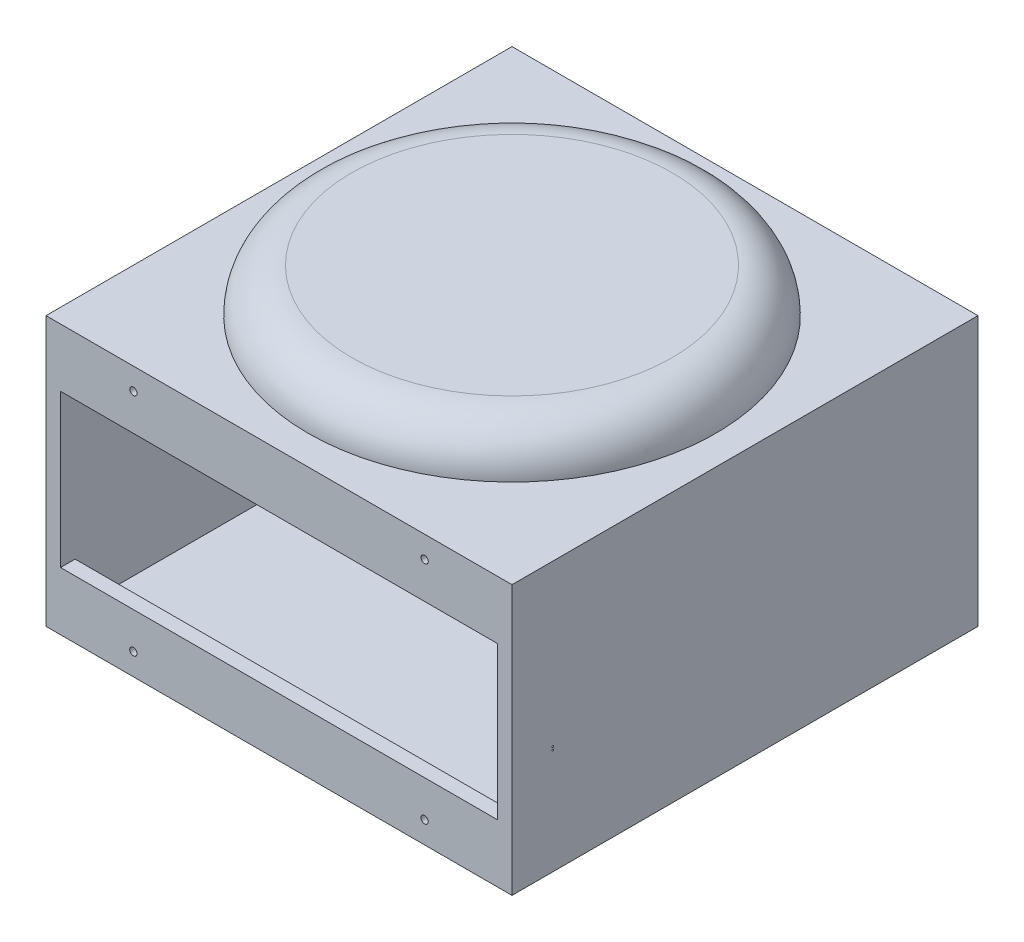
ISO-10303-21;
HEADER;
FILE_DESCRIPTION(('STEP AP214'),'2;1');
FILE_NAME('part.step','',(''),(''),'','','');
FILE_SCHEMA(('AUTOMOTIVE_DESIGN { 1 0 10303 214 1 1 1 1 }'));
ENDSEC;
DATA;
#1=APPLICATION_CONTEXT('core data for automotive mechanical design processes');
#2=APPLICATION_PROTOCOL_DEFINITION('international standard','automotive_design',2000,#1);
#3=PRODUCT_CONTEXT('',#1,'mechanical');
#4=PRODUCT('Part','Part','',(#3));
#5=PRODUCT_RELATED_PRODUCT_CATEGORY('part','',(#4));
#6=PRODUCT_DEFINITION_FORMATION('','',#4);
#7=PRODUCT_DEFINITION_CONTEXT('part definition',#1,'design');
#8=PRODUCT_DEFINITION('design','',#6,#7);
#9=PRODUCT_DEFINITION_SHAPE('','',#8);
#10=(LENGTH_UNIT() NAMED_UNIT(*) SI_UNIT(.MILLI.,.METRE.));
#11=(NAMED_UNIT(*) PLANE_ANGLE_UNIT() SI_UNIT($,.RADIAN.));
#12=(NAMED_UNIT(*) SI_UNIT($,.STERADIAN.) SOLID_ANGLE_UNIT());
#13=UNCERTAINTY_MEASURE_WITH_UNIT(LENGTH_MEASURE(1.E-05),#10,'distance_accuracy_value','');
#14=(GEOMETRIC_REPRESENTATION_CONTEXT(3) GLOBAL_UNCERTAINTY_ASSIGNED_CONTEXT((#13)) GLOBAL_UNIT_ASSIGNED_CONTEXT((#10,
#11,#12)) REPRESENTATION_CONTEXT('',''));
#15=CARTESIAN_POINT('',(0.,0.,0.));
#16=DIRECTION('',(0.,0.,1.));
#17=DIRECTION('',(1.,0.,0.));
#18=AXIS2_PLACEMENT_3D('',#15,#16,#17);
#19=CARTESIAN_POINT('',(6.34999999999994,6.35,6.34999999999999));
#20=DIRECTION('',(-1.,0.,0.));
#21=DIRECTION('',(0.,0.,1.));
#22=AXIS2_PLACEMENT_3D('',#19,#20,#21);
#23=PLANE('',#22);
#24=DIRECTION('',(0.,-1.,0.));
#25=VECTOR('',#24,1.);
#26=CARTESIAN_POINT('',(6.34999999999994,25.4000000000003,196.85));
#27=LINE('',#26,#25);
#28=CARTESIAN_POINT('',(6.34999999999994,25.4000000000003,196.85));
#29=VERTEX_POINT('',#28);
#30=CARTESIAN_POINT('',(6.34999999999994,6.35,196.85));
#31=VERTEX_POINT('',#30);
#32=EDGE_CURVE('E150',#29,#31,#27,.T.);
#33=ORIENTED_EDGE('',*,*,#32,.T.);
#34=DIRECTION('',(0.,0.,1.));
#35=VECTOR('',#34,1.);
#36=CARTESIAN_POINT('',(6.34999999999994,6.35,6.34999999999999));
#37=LINE('',#36,#35);
#38=CARTESIAN_POINT('',(6.34999999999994,6.35,6.34999999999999));
#39=VERTEX_POINT('',#38);
#40=EDGE_CURVE('E137',#39,#31,#37,.T.);
#41=ORIENTED_EDGE('',*,*,#40,.F.);
#42=DIRECTION('',(0.,-1.,0.));
#43=VECTOR('',#42,1.);
#44=CARTESIAN_POINT('',(6.34999999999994,6.35,6.34999999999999));
#45=LINE('',#44,#43);
#46=CARTESIAN_POINT('',(6.34999999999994,110.998,6.34999999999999));
#47=VERTEX_POINT('',#46);
#48=EDGE_CURVE('E198',#47,#39,#45,.T.);
#49=ORIENTED_EDGE('',*,*,#48,.F.);
#50=DIRECTION('',(0.,0.,1.));
#51=VECTOR('',#50,1.);
#52=CARTESIAN_POINT('',(6.34999999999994,110.998,6.34999999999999));
#53=LINE('',#52,#51);
#54=CARTESIAN_POINT('',(6.34999999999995,110.998,196.85));
#55=VERTEX_POINT('',#54);
#56=EDGE_CURVE('E215',#47,#55,#53,.T.);
#57=ORIENTED_EDGE('',*,*,#56,.T.);
#58=DIRECTION('',(0.,1.,0.));
#59=VECTOR('',#58,1.);
#60=CARTESIAN_POINT('',(6.34999999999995,91.9479999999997,196.85));
#61=LINE('',#60,#59);
#62=CARTESIAN_POINT('',(6.34999999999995,91.9479999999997,196.85));
#63=VERTEX_POINT('',#62);
#64=EDGE_CURVE('E194',#63,#55,#61,.T.);
#65=ORIENTED_EDGE('',*,*,#64,.F.);
#66=DIRECTION('',(0.,0.,-1.));
#67=VECTOR('',#66,1.);
#68=CARTESIAN_POINT('',(6.34999999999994,91.9479999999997,203.2));
#69=LINE('',#68,#67);
#70=CARTESIAN_POINT('',(6.34999999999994,91.9479999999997,203.2));
#71=VERTEX_POINT('',#70);
#72=EDGE_CURVE('E173',#71,#63,#69,.T.);
#73=ORIENTED_EDGE('',*,*,#72,.F.);
#74=DIRECTION('',(0.,-1.,0.));
#75=VECTOR('',#74,1.);
#76=CARTESIAN_POINT('',(6.34999999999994,6.35,203.2));
#77=LINE('',#76,#75);
#78=CARTESIAN_POINT('',(6.34999999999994,25.4000000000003,203.2));
#79=VERTEX_POINT('',#78);
#80=EDGE_CURVE('E197',#71,#79,#77,.T.);
#81=ORIENTED_EDGE('',*,*,#80,.T.);
#82=DIRECTION('',(0.,0.,1.));
#83=VECTOR('',#82,1.);
#84=CARTESIAN_POINT('',(6.34999999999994,25.4000000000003,203.2));
#85=LINE('',#84,#83);
#86=EDGE_CURVE('E62',#29,#79,#85,.T.);
#87=ORIENTED_EDGE('',*,*,#86,.F.);
#88=EDGE_LOOP('',(#33,#41,#49,#57,#65,#73,#81,#87));
#89=FACE_BOUND('',#88,.T.);
#90=ADVANCED_FACE('F46',(#89),#23,.F.);
#91=CARTESIAN_POINT('',(196.85,6.35,6.34999999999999));
#92=DIRECTION('',(1.,0.,0.));
#93=DIRECTION('',(0.,0.,-1.));
#94=AXIS2_PLACEMENT_3D('',#91,#92,#93);
#95=PLANE('',#94);
#96=DIRECTION('',(0.,-1.,0.));
#97=VECTOR('',#96,1.);
#98=CARTESIAN_POINT('',(196.85,25.4000000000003,196.85));
#99=LINE('',#98,#97);
#100=CARTESIAN_POINT('',(196.85,25.4000000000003,196.85));
#101=VERTEX_POINT('',#100);
#102=CARTESIAN_POINT('',(196.85,6.35,196.85));
#103=VERTEX_POINT('',#102);
#104=EDGE_CURVE('E70',#101,#103,#99,.T.);
#105=ORIENTED_EDGE('',*,*,#104,.F.);
#106=DIRECTION('',(0.,0.,-1.));
#107=VECTOR('',#106,1.);
#108=CARTESIAN_POINT('',(196.85,25.4000000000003,203.2));
#109=LINE('',#108,#107);
#110=CARTESIAN_POINT('',(196.85,25.4000000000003,203.2));
#111=VERTEX_POINT('',#110);
#112=EDGE_CURVE('E312',#111,#101,#109,.T.);
#113=ORIENTED_EDGE('',*,*,#112,.F.);
#114=DIRECTION('',(0.,1.,0.));
#115=VECTOR('',#114,1.);
#116=CARTESIAN_POINT('',(196.85,6.35,203.2));
#117=LINE('',#116,#115);
#118=CARTESIAN_POINT('',(196.85,91.9479999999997,203.2));
#119=VERTEX_POINT('',#118);
#120=EDGE_CURVE('E201',#111,#119,#117,.T.);
#121=ORIENTED_EDGE('',*,*,#120,.T.);
#122=DIRECTION('',(0.,0.,1.));
#123=VECTOR('',#122,1.);
#124=CARTESIAN_POINT('',(196.85,91.9479999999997,203.2));
#125=LINE('',#124,#123);
#126=CARTESIAN_POINT('',(196.85,91.9479999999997,196.85));
#127=VERTEX_POINT('',#126);
#128=EDGE_CURVE('E181',#127,#119,#125,.T.);
#129=ORIENTED_EDGE('',*,*,#128,.F.);
#130=DIRECTION('',(0.,1.,0.));
#131=VECTOR('',#130,1.);
#132=CARTESIAN_POINT('',(196.85,91.9479999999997,196.85));
#133=LINE('',#132,#131);
#134=CARTESIAN_POINT('',(196.85,110.998,196.85));
#135=VERTEX_POINT('',#134);
#136=EDGE_CURVE('E188',#127,#135,#133,.T.);
#137=ORIENTED_EDGE('',*,*,#136,.T.);
#138=DIRECTION('',(0.,0.,1.));
#139=VECTOR('',#138,1.);
#140=CARTESIAN_POINT('',(196.85,110.998,6.34999999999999));
#141=LINE('',#140,#139);
#142=CARTESIAN_POINT('',(196.85,110.998,6.34999999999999));
#143=VERTEX_POINT('',#142);
#144=EDGE_CURVE('E220',#143,#135,#141,.T.);
#145=ORIENTED_EDGE('',*,*,#144,.F.);
#146=DIRECTION('',(0.,1.,0.));
#147=VECTOR('',#146,1.);
#148=CARTESIAN_POINT('',(196.85,6.35,6.34999999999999));
#149=LINE('',#148,#147);
#150=CARTESIAN_POINT('',(196.85,6.35,6.34999999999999));
#151=VERTEX_POINT('',#150);
#152=EDGE_CURVE('E204',#151,#143,#149,.T.);
#153=ORIENTED_EDGE('',*,*,#152,.F.);
#154=DIRECTION('',(0.,0.,1.));
#155=VECTOR('',#154,1.);
#156=CARTESIAN_POINT('',(196.85,6.35,6.34999999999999));
#157=LINE('',#156,#155);
#158=EDGE_CURVE('E146',#151,#103,#157,.T.);
#159=ORIENTED_EDGE('',*,*,#158,.T.);
#160=EDGE_LOOP('',(#105,#113,#121,#129,#137,#145,#153,#159));
#161=FACE_BOUND('',#160,.T.);
#162=ADVANCED_FACE('F325',(#161),#95,.F.);
#163=CARTESIAN_POINT('',(6.34999999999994,6.35,6.34999999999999));
#164=DIRECTION('',(0.,-1.,0.));
#165=DIRECTION('',(0.,0.,-1.));
#166=AXIS2_PLACEMENT_3D('',#163,#164,#165);
#167=PLANE('',#166);
#168=DIRECTION('',(-1.,0.,0.));
#169=VECTOR('',#168,1.);
#170=CARTESIAN_POINT('',(6.34999999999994,6.35,196.85));
#171=LINE('',#170,#169);
#172=EDGE_CURVE('E140',#103,#31,#171,.T.);
#173=ORIENTED_EDGE('',*,*,#172,.F.);
#174=ORIENTED_EDGE('',*,*,#158,.F.);
#175=DIRECTION('',(1.,0.,0.));
#176=VECTOR('',#175,1.);
#177=CARTESIAN_POINT('',(6.34999999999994,6.35,6.34999999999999));
#178=LINE('',#177,#176);
#179=EDGE_CURVE('E142',#39,#151,#178,.T.);
#180=ORIENTED_EDGE('',*,*,#179,.F.);
#181=ORIENTED_EDGE('',*,*,#40,.T.);
#182=EDGE_LOOP('',(#173,#174,#180,#181));
#183=FACE_BOUND('',#182,.T.);
#184=ADVANCED_FACE('F138',(#183),#167,.F.);
#185=CARTESIAN_POINT('',(6.34999999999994,110.998,6.34999999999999));
#186=DIRECTION('',(0.,1.,0.));
#187=DIRECTION('',(0.,0.,1.));
#188=AXIS2_PLACEMENT_3D('',#185,#186,#187);
#189=PLANE('',#188);
#190=DIRECTION('',(1.,0.,0.));
#191=VECTOR('',#190,1.);
#192=CARTESIAN_POINT('',(6.34999999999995,110.998,196.85));
#193=LINE('',#192,#191);
#194=EDGE_CURVE('E172',#55,#135,#193,.T.);
#195=ORIENTED_EDGE('',*,*,#194,.F.);
#196=ORIENTED_EDGE('',*,*,#56,.F.);
#197=DIRECTION('',(-1.,0.,0.));
#198=VECTOR('',#197,1.);
#199=CARTESIAN_POINT('',(6.34999999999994,110.998,6.34999999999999));
#200=LINE('',#199,#198);
#201=EDGE_CURVE('E147',#143,#47,#200,.T.);
#202=ORIENTED_EDGE('',*,*,#201,.F.);
#203=ORIENTED_EDGE('',*,*,#144,.T.);
#204=EDGE_LOOP('',(#195,#196,#202,#203));
#205=FACE_BOUND('',#204,.T.);
#206=ADVANCED_FACE('F336',(#205),#189,.F.);
#207=CARTESIAN_POINT('',(0.,0.,203.2));
#208=DIRECTION('',(1.,0.,0.));
#209=DIRECTION('',(0.,1.,0.));
#210=AXIS2_PLACEMENT_3D('',#207,#208,#209);
#211=PLANE('',#210);
#212=DIRECTION('',(0.,-1.,0.));
#213=VECTOR('',#212,1.);
#214=CARTESIAN_POINT('',(0.,0.,0.));
#215=LINE('',#214,#213);
#216=CARTESIAN_POINT('',(0.,117.348,0.));
#217=VERTEX_POINT('',#216);
#218=CARTESIAN_POINT('',(0.,0.,0.));
#219=VERTEX_POINT('',#218);
#220=EDGE_CURVE('E219',#217,#219,#215,.T.);
#221=ORIENTED_EDGE('',*,*,#220,.T.);
#222=DIRECTION('',(0.,0.,-1.));
#223=VECTOR('',#222,1.);
#224=CARTESIAN_POINT('',(0.,0.,203.2));
#225=LINE('',#224,#223);
#226=CARTESIAN_POINT('',(0.,0.,203.2));
#227=VERTEX_POINT('',#226);
#228=EDGE_CURVE('E263',#227,#219,#225,.T.);
#229=ORIENTED_EDGE('',*,*,#228,.F.);
#230=DIRECTION('',(0.,-1.,0.));
#231=VECTOR('',#230,1.);
#232=CARTESIAN_POINT('',(0.,0.,203.2));
#233=LINE('',#232,#231);
#234=CARTESIAN_POINT('',(0.,117.348,203.2));
#235=VERTEX_POINT('',#234);
#236=EDGE_CURVE('E226',#235,#227,#233,.T.);
#237=ORIENTED_EDGE('',*,*,#236,.F.);
#238=DIRECTION('',(0.,0.,-1.));
#239=VECTOR('',#238,1.);
#240=CARTESIAN_POINT('',(0.,117.348,203.2));
#241=LINE('',#240,#239);
#242=EDGE_CURVE('E240',#235,#217,#241,.T.);
#243=ORIENTED_EDGE('',*,*,#242,.T.);
#244=EDGE_LOOP('',(#221,#229,#237,#243));
#245=FACE_BOUND('',#244,.T.);
#246=ADVANCED_FACE('F373',(#245),#211,.F.);
#247=CARTESIAN_POINT('',(0.,0.,203.2));
#248=DIRECTION('',(0.,1.,0.));
#249=DIRECTION('',(0.,0.,1.));
#250=AXIS2_PLACEMENT_3D('',#247,#248,#249);
#251=PLANE('',#250);
#252=CARTESIAN_POINT('',(101.6,0.,101.6));
#253=DIRECTION('',(0.,-1.,0.));
#254=DIRECTION('',(0.,0.,-1.));
#255=AXIS2_PLACEMENT_3D('',#252,#253,#254);
#256=CIRCLE('',#255,88.9);
#257=CARTESIAN_POINT('',(101.6,0.,12.7));
#258=VERTEX_POINT('',#257);
#259=EDGE_CURVE('E55',#258,#258,#256,.T.);
#260=ORIENTED_EDGE('',*,*,#259,.F.);
#261=EDGE_LOOP('',(#260));
#262=FACE_BOUND('',#261,.T.);
#263=DIRECTION('',(1.,0.,0.));
#264=VECTOR('',#263,1.);
#265=CARTESIAN_POINT('',(0.,0.,0.));
#266=LINE('',#265,#264);
#267=CARTESIAN_POINT('',(203.2,0.,0.));
#268=VERTEX_POINT('',#267);
#269=EDGE_CURVE('E244',#219,#268,#266,.T.);
#270=ORIENTED_EDGE('',*,*,#269,.T.);
#271=DIRECTION('',(0.,0.,-1.));
#272=VECTOR('',#271,1.);
#273=CARTESIAN_POINT('',(203.2,0.,203.2));
#274=LINE('',#273,#272);
#275=CARTESIAN_POINT('',(203.2,0.,203.2));
#276=VERTEX_POINT('',#275);
#277=EDGE_CURVE('E259',#276,#268,#274,.T.);
#278=ORIENTED_EDGE('',*,*,#277,.F.);
#279=DIRECTION('',(1.,0.,0.));
#280=VECTOR('',#279,1.);
#281=CARTESIAN_POINT('',(0.,0.,203.2));
#282=LINE('',#281,#280);
#283=EDGE_CURVE('E230',#227,#276,#282,.T.);
#284=ORIENTED_EDGE('',*,*,#283,.F.);
#285=ORIENTED_EDGE('',*,*,#228,.T.);
#286=EDGE_LOOP('',(#270,#278,#284,#285));
#287=FACE_BOUND('',#286,.T.);
#288=ADVANCED_FACE('F369',(#262,#287),#251,.F.);
#289=CARTESIAN_POINT('',(203.2,0.,203.2));
#290=DIRECTION('',(-1.,0.,0.));
#291=DIRECTION('',(0.,-1.,0.));
#292=AXIS2_PLACEMENT_3D('',#289,#290,#291);
#293=PLANE('',#292);
#294=CARTESIAN_POINT('',(203.2,47.3334352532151,185.42));
#295=DIRECTION('',(1.,0.,0.));
#296=DIRECTION('',(0.,1.,0.));
#297=AXIS2_PLACEMENT_3D('',#294,#295,#296);
#298=CIRCLE('',#297,0.380999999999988);
#299=CARTESIAN_POINT('',(203.2,47.7144352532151,185.42));
#300=VERTEX_POINT('',#299);
#301=EDGE_CURVE('E660',#300,#300,#298,.T.);
#302=ORIENTED_EDGE('',*,*,#301,.F.);
#303=EDGE_LOOP('',(#302));
#304=FACE_BOUND('',#303,.T.);
#305=CARTESIAN_POINT('',(203.2,46.0634352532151,185.42));
#306=DIRECTION('',(1.,0.,0.));
#307=DIRECTION('',(0.,1.,0.));
#308=AXIS2_PLACEMENT_3D('',#305,#306,#307);
#309=CIRCLE('',#308,0.380999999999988);
#310=CARTESIAN_POINT('',(203.2,46.4444352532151,185.42));
#311=VERTEX_POINT('',#310);
#312=EDGE_CURVE('E664',#311,#311,#309,.T.);
#313=ORIENTED_EDGE('',*,*,#312,.F.);
#314=EDGE_LOOP('',(#313));
#315=FACE_BOUND('',#314,.T.);
#316=DIRECTION('',(0.,1.,0.));
#317=VECTOR('',#316,1.);
#318=CARTESIAN_POINT('',(203.2,0.,0.));
#319=LINE('',#318,#317);
#320=CARTESIAN_POINT('',(203.2,117.348,0.));
#321=VERTEX_POINT('',#320);
#322=EDGE_CURVE('E247',#268,#321,#319,.T.);
#323=ORIENTED_EDGE('',*,*,#322,.T.);
#324=DIRECTION('',(0.,0.,-1.));
#325=VECTOR('',#324,1.);
#326=CARTESIAN_POINT('',(203.2,117.348,203.2));
#327=LINE('',#326,#325);
#328=CARTESIAN_POINT('',(203.2,117.348,203.2));
#329=VERTEX_POINT('',#328);
#330=EDGE_CURVE('E255',#329,#321,#327,.T.);
#331=ORIENTED_EDGE('',*,*,#330,.F.);
#332=DIRECTION('',(0.,1.,0.));
#333=VECTOR('',#332,1.);
#334=CARTESIAN_POINT('',(203.2,0.,203.2));
#335=LINE('',#334,#333);
#336=EDGE_CURVE('E234',#276,#329,#335,.T.);
#337=ORIENTED_EDGE('',*,*,#336,.F.);
#338=ORIENTED_EDGE('',*,*,#277,.T.);
#339=EDGE_LOOP('',(#323,#331,#337,#338));
#340=FACE_BOUND('',#339,.T.);
#341=ADVANCED_FACE('F365',(#304,#315,#340),#293,.F.);
#342=CARTESIAN_POINT('',(0.,117.348,203.2));
#343=DIRECTION('',(0.,-1.,0.));
#344=DIRECTION('',(0.,0.,-1.));
#345=AXIS2_PLACEMENT_3D('',#342,#343,#344);
#346=PLANE('',#345);
#347=CARTESIAN_POINT('',(101.6,117.348,101.6));
#348=DIRECTION('',(0.,1.,0.));
#349=DIRECTION('',(0.,0.,1.));
#350=AXIS2_PLACEMENT_3D('',#347,#348,#349);
#351=CIRCLE('',#350,88.9);
#352=CARTESIAN_POINT('',(101.6,117.348,190.5));
#353=VERTEX_POINT('',#352);
#354=EDGE_CURVE('E266',#353,#353,#351,.T.);
#355=ORIENTED_EDGE('',*,*,#354,.F.);
#356=EDGE_LOOP('',(#355));
#357=FACE_BOUND('',#356,.T.);
#358=DIRECTION('',(-1.,0.,0.));
#359=VECTOR('',#358,1.);
#360=CARTESIAN_POINT('',(0.,117.348,0.));
#361=LINE('',#360,#359);
#362=EDGE_CURVE('E231',#321,#217,#361,.T.);
#363=ORIENTED_EDGE('',*,*,#362,.T.);
#364=ORIENTED_EDGE('',*,*,#242,.F.);
#365=DIRECTION('',(-1.,0.,0.));
#366=VECTOR('',#365,1.);
#367=CARTESIAN_POINT('',(0.,117.348,203.2));
#368=LINE('',#367,#366);
#369=EDGE_CURVE('E237',#329,#235,#368,.T.);
#370=ORIENTED_EDGE('',*,*,#369,.F.);
#371=ORIENTED_EDGE('',*,*,#330,.T.);
#372=EDGE_LOOP('',(#363,#364,#370,#371));
#373=FACE_BOUND('',#372,.T.);
#374=ADVANCED_FACE('F360',(#357,#373),#346,.F.);
#375=CARTESIAN_POINT('',(0.,0.,203.2));
#376=DIRECTION('',(0.,0.,-1.));
#377=DIRECTION('',(-1.,0.,0.));
#378=AXIS2_PLACEMENT_3D('',#375,#376,#377);
#379=PLANE('',#378);
#380=CARTESIAN_POINT('',(38.0999999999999,9.52499999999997,203.2));
#381=DIRECTION('',(0.,0.,1.));
#382=DIRECTION('',(1.,0.,0.));
#383=AXIS2_PLACEMENT_3D('',#380,#381,#382);
#384=CIRCLE('',#383,1.5875);
#385=CARTESIAN_POINT('',(39.6874999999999,9.52499999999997,203.2));
#386=VERTEX_POINT('',#385);
#387=EDGE_CURVE('E299',#386,#386,#384,.T.);
#388=ORIENTED_EDGE('',*,*,#387,.F.);
#389=EDGE_LOOP('',(#388));
#390=FACE_BOUND('',#389,.T.);
#391=CARTESIAN_POINT('',(165.1,9.52500000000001,203.2));
#392=DIRECTION('',(0.,0.,1.));
#393=DIRECTION('',(1.,0.,0.));
#394=AXIS2_PLACEMENT_3D('',#391,#392,#393);
#395=CIRCLE('',#394,1.58749999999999);
#396=CARTESIAN_POINT('',(166.6875,9.52500000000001,203.2));
#397=VERTEX_POINT('',#396);
#398=EDGE_CURVE('E291',#397,#397,#395,.T.);
#399=ORIENTED_EDGE('',*,*,#398,.F.);
#400=EDGE_LOOP('',(#399));
#401=FACE_BOUND('',#400,.T.);
#402=CARTESIAN_POINT('',(165.1,107.823,203.2));
#403=DIRECTION('',(0.,0.,1.));
#404=DIRECTION('',(1.,0.,0.));
#405=AXIS2_PLACEMENT_3D('',#402,#403,#404);
#406=CIRCLE('',#405,1.58749999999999);
#407=CARTESIAN_POINT('',(166.6875,107.823,203.2));
#408=VERTEX_POINT('',#407);
#409=EDGE_CURVE('E282',#408,#408,#406,.T.);
#410=ORIENTED_EDGE('',*,*,#409,.F.);
#411=EDGE_LOOP('',(#410));
#412=FACE_BOUND('',#411,.T.);
#413=CARTESIAN_POINT('',(38.0999999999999,107.823,203.2));
#414=DIRECTION('',(0.,0.,1.));
#415=DIRECTION('',(1.,0.,0.));
#416=AXIS2_PLACEMENT_3D('',#413,#414,#415);
#417=CIRCLE('',#416,1.5875);
#418=CARTESIAN_POINT('',(39.6874999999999,107.823,203.2));
#419=VERTEX_POINT('',#418);
#420=EDGE_CURVE('E158',#419,#419,#417,.T.);
#421=ORIENTED_EDGE('',*,*,#420,.F.);
#422=EDGE_LOOP('',(#421));
#423=FACE_BOUND('',#422,.T.);
#424=ORIENTED_EDGE('',*,*,#120,.F.);
#425=DIRECTION('',(1.,0.,0.));
#426=VECTOR('',#425,1.);
#427=CARTESIAN_POINT('',(6.34999999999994,25.4000000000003,203.2));
#428=LINE('',#427,#426);
#429=EDGE_CURVE('E162',#79,#111,#428,.T.);
#430=ORIENTED_EDGE('',*,*,#429,.F.);
#431=ORIENTED_EDGE('',*,*,#80,.F.);
#432=DIRECTION('',(-1.,0.,0.));
#433=VECTOR('',#432,1.);
#434=CARTESIAN_POINT('',(6.34999999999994,91.9479999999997,203.2));
#435=LINE('',#434,#433);
#436=EDGE_CURVE('E185',#119,#71,#435,.T.);
#437=ORIENTED_EDGE('',*,*,#436,.F.);
#438=EDGE_LOOP('',(#424,#430,#431,#437));
#439=FACE_BOUND('',#438,.T.);
#440=ORIENTED_EDGE('',*,*,#236,.T.);
#441=ORIENTED_EDGE('',*,*,#283,.T.);
#442=ORIENTED_EDGE('',*,*,#336,.T.);
#443=ORIENTED_EDGE('',*,*,#369,.T.);
#444=EDGE_LOOP('',(#440,#441,#442,#443));
#445=FACE_BOUND('',#444,.T.);
#446=ADVANCED_FACE('F321',(#390,#401,#412,#423,#439,#445),#379,.F.);
#447=CARTESIAN_POINT('',(0.,0.,0.));
#448=DIRECTION('',(0.,0.,-1.));
#449=DIRECTION('',(-1.,0.,0.));
#450=AXIS2_PLACEMENT_3D('',#447,#448,#449);
#451=PLANE('',#450);
#452=ORIENTED_EDGE('',*,*,#220,.F.);
#453=ORIENTED_EDGE('',*,*,#362,.F.);
#454=ORIENTED_EDGE('',*,*,#322,.F.);
#455=ORIENTED_EDGE('',*,*,#269,.F.);
#456=EDGE_LOOP('',(#452,#453,#454,#455));
#457=FACE_BOUND('',#456,.T.);
#458=ADVANCED_FACE('F340',(#457),#451,.T.);
#459=CARTESIAN_POINT('',(0.,0.,6.34999999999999));
#460=DIRECTION('',(0.,0.,-1.));
#461=DIRECTION('',(-1.,0.,0.));
#462=AXIS2_PLACEMENT_3D('',#459,#460,#461);
#463=PLANE('',#462);
#464=ORIENTED_EDGE('',*,*,#48,.T.);
#465=ORIENTED_EDGE('',*,*,#179,.T.);
#466=ORIENTED_EDGE('',*,*,#152,.T.);
#467=ORIENTED_EDGE('',*,*,#201,.T.);
#468=EDGE_LOOP('',(#464,#465,#466,#467));
#469=FACE_BOUND('',#468,.T.);
#470=ADVANCED_FACE('F338',(#469),#463,.F.);
#471=CARTESIAN_POINT('',(6.34999999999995,91.9479999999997,196.85));
#472=DIRECTION('',(0.,0.,1.));
#473=DIRECTION('',(1.,0.,0.));
#474=AXIS2_PLACEMENT_3D('',#471,#472,#473);
#475=PLANE('',#474);
#476=CARTESIAN_POINT('',(165.1,107.823,196.85));
#477=DIRECTION('',(0.,0.,1.));
#478=DIRECTION('',(1.,0.,0.));
#479=AXIS2_PLACEMENT_3D('',#476,#477,#478);
#480=CIRCLE('',#479,1.58749999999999);
#481=CARTESIAN_POINT('',(166.6875,107.823,196.85));
#482=VERTEX_POINT('',#481);
#483=EDGE_CURVE('E286',#482,#482,#480,.F.);
#484=ORIENTED_EDGE('',*,*,#483,.F.);
#485=EDGE_LOOP('',(#484));
#486=FACE_BOUND('',#485,.T.);
#487=CARTESIAN_POINT('',(38.0999999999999,107.823,196.85));
#488=DIRECTION('',(0.,0.,1.));
#489=DIRECTION('',(1.,0.,0.));
#490=AXIS2_PLACEMENT_3D('',#487,#488,#489);
#491=CIRCLE('',#490,1.5875);
#492=CARTESIAN_POINT('',(39.6874999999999,107.823,196.85));
#493=VERTEX_POINT('',#492);
#494=EDGE_CURVE('E165',#493,#493,#491,.F.);
#495=ORIENTED_EDGE('',*,*,#494,.F.);
#496=EDGE_LOOP('',(#495));
#497=FACE_BOUND('',#496,.T.);
#498=ORIENTED_EDGE('',*,*,#194,.T.);
#499=ORIENTED_EDGE('',*,*,#136,.F.);
#500=DIRECTION('',(1.,0.,0.));
#501=VECTOR('',#500,1.);
#502=CARTESIAN_POINT('',(6.34999999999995,91.9479999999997,196.85));
#503=LINE('',#502,#501);
#504=EDGE_CURVE('E177',#63,#127,#503,.T.);
#505=ORIENTED_EDGE('',*,*,#504,.F.);
#506=ORIENTED_EDGE('',*,*,#64,.T.);
#507=EDGE_LOOP('',(#498,#499,#505,#506));
#508=FACE_BOUND('',#507,.T.);
#509=ADVANCED_FACE('F331',(#486,#497,#508),#475,.F.);
#510=CARTESIAN_POINT('',(0.,91.9479999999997,0.));
#511=DIRECTION('',(0.,-1.,0.));
#512=DIRECTION('',(0.,0.,-1.));
#513=AXIS2_PLACEMENT_3D('',#510,#511,#512);
#514=PLANE('',#513);
#515=ORIENTED_EDGE('',*,*,#72,.T.);
#516=ORIENTED_EDGE('',*,*,#504,.T.);
#517=ORIENTED_EDGE('',*,*,#128,.T.);
#518=ORIENTED_EDGE('',*,*,#436,.T.);
#519=EDGE_LOOP('',(#515,#516,#517,#518));
#520=FACE_BOUND('',#519,.T.);
#521=ADVANCED_FACE('F327',(#520),#514,.T.);
#522=CARTESIAN_POINT('',(6.34999999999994,25.4000000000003,196.85));
#523=DIRECTION('',(0.,0.,1.));
#524=DIRECTION('',(1.,0.,0.));
#525=AXIS2_PLACEMENT_3D('',#522,#523,#524);
#526=PLANE('',#525);
#527=CARTESIAN_POINT('',(38.0999999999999,9.52499999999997,196.85));
#528=DIRECTION('',(0.,0.,1.));
#529=DIRECTION('',(1.,0.,0.));
#530=AXIS2_PLACEMENT_3D('',#527,#528,#529);
#531=CIRCLE('',#530,1.5875);
#532=CARTESIAN_POINT('',(39.6874999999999,9.52499999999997,196.85));
#533=VERTEX_POINT('',#532);
#534=EDGE_CURVE('E295',#533,#533,#531,.F.);
#535=ORIENTED_EDGE('',*,*,#534,.F.);
#536=EDGE_LOOP('',(#535));
#537=FACE_BOUND('',#536,.T.);
#538=CARTESIAN_POINT('',(165.1,9.52500000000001,196.85));
#539=DIRECTION('',(0.,0.,1.));
#540=DIRECTION('',(1.,0.,0.));
#541=AXIS2_PLACEMENT_3D('',#538,#539,#540);
#542=CIRCLE('',#541,1.58749999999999);
#543=CARTESIAN_POINT('',(166.6875,9.52500000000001,196.85));
#544=VERTEX_POINT('',#543);
#545=EDGE_CURVE('E287',#544,#544,#542,.F.);
#546=ORIENTED_EDGE('',*,*,#545,.F.);
#547=EDGE_LOOP('',(#546));
#548=FACE_BOUND('',#547,.T.);
#549=ORIENTED_EDGE('',*,*,#172,.T.);
#550=ORIENTED_EDGE('',*,*,#32,.F.);
#551=DIRECTION('',(-1.,0.,0.));
#552=VECTOR('',#551,1.);
#553=CARTESIAN_POINT('',(6.34999999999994,25.4000000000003,196.85));
#554=LINE('',#553,#552);
#555=EDGE_CURVE('E154',#101,#29,#554,.T.);
#556=ORIENTED_EDGE('',*,*,#555,.F.);
#557=ORIENTED_EDGE('',*,*,#104,.T.);
#558=EDGE_LOOP('',(#549,#550,#556,#557));
#559=FACE_BOUND('',#558,.T.);
#560=ADVANCED_FACE('F156',(#537,#548,#559),#526,.F.);
#561=CARTESIAN_POINT('',(0.,25.4000000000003,0.));
#562=DIRECTION('',(0.,-1.,0.));
#563=DIRECTION('',(0.,0.,-1.));
#564=AXIS2_PLACEMENT_3D('',#561,#562,#563);
#565=PLANE('',#564);
#566=ORIENTED_EDGE('',*,*,#86,.T.);
#567=ORIENTED_EDGE('',*,*,#429,.T.);
#568=ORIENTED_EDGE('',*,*,#112,.T.);
#569=ORIENTED_EDGE('',*,*,#555,.T.);
#570=EDGE_LOOP('',(#566,#567,#568,#569));
#571=FACE_BOUND('',#570,.T.);
#572=ADVANCED_FACE('F316',(#571),#565,.F.);
#573=CARTESIAN_POINT('',(165.1,9.52500000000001,-0.001000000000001));
#574=DIRECTION('',(0.,0.,1.));
#575=DIRECTION('',(1.,0.,0.));
#576=AXIS2_PLACEMENT_3D('',#573,#574,#575);
#577=CYLINDRICAL_SURFACE('',#576,1.58749999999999);
#578=ORIENTED_EDGE('',*,*,#398,.T.);
#579=EDGE_LOOP('',(#578));
#580=FACE_BOUND('',#579,.T.);
#581=ORIENTED_EDGE('',*,*,#545,.T.);
#582=EDGE_LOOP('',(#581));
#583=FACE_BOUND('',#582,.T.);
#584=ADVANCED_FACE('F398',(#580,#583),#577,.F.);
#585=CARTESIAN_POINT('',(38.0999999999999,9.52499999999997,-0.001000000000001));
#586=DIRECTION('',(0.,0.,1.));
#587=DIRECTION('',(1.,0.,0.));
#588=AXIS2_PLACEMENT_3D('',#585,#586,#587);
#589=CYLINDRICAL_SURFACE('',#588,1.5875);
#590=ORIENTED_EDGE('',*,*,#387,.T.);
#591=EDGE_LOOP('',(#590));
#592=FACE_BOUND('',#591,.T.);
#593=ORIENTED_EDGE('',*,*,#534,.T.);
#594=EDGE_LOOP('',(#593));
#595=FACE_BOUND('',#594,.T.);
#596=ADVANCED_FACE('F401',(#592,#595),#589,.F.);
#597=CARTESIAN_POINT('',(38.0999999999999,107.823,-0.001000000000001));
#598=DIRECTION('',(0.,0.,1.));
#599=DIRECTION('',(1.,0.,0.));
#600=AXIS2_PLACEMENT_3D('',#597,#598,#599);
#601=CYLINDRICAL_SURFACE('',#600,1.5875);
#602=ORIENTED_EDGE('',*,*,#420,.T.);
#603=EDGE_LOOP('',(#602));
#604=FACE_BOUND('',#603,.T.);
#605=ORIENTED_EDGE('',*,*,#494,.T.);
#606=EDGE_LOOP('',(#605));
#607=FACE_BOUND('',#606,.T.);
#608=ADVANCED_FACE('F393',(#604,#607),#601,.F.);
#609=CARTESIAN_POINT('',(165.1,107.823,-0.001000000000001));
#610=DIRECTION('',(0.,0.,1.));
#611=DIRECTION('',(1.,0.,0.));
#612=AXIS2_PLACEMENT_3D('',#609,#610,#611);
#613=CYLINDRICAL_SURFACE('',#612,1.58749999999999);
#614=ORIENTED_EDGE('',*,*,#409,.T.);
#615=EDGE_LOOP('',(#614));
#616=FACE_BOUND('',#615,.T.);
#617=ORIENTED_EDGE('',*,*,#483,.T.);
#618=EDGE_LOOP('',(#617));
#619=FACE_BOUND('',#618,.T.);
#620=ADVANCED_FACE('F387',(#616,#619),#613,.F.);
#621=CARTESIAN_POINT('',(101.6,136.398,101.6));
#622=DIRECTION('',(0.,1.,0.));
#623=DIRECTION('',(0.,0.,1.));
#624=AXIS2_PLACEMENT_3D('',#621,#622,#623);
#625=PLANE('',#624);
#626=CARTESIAN_POINT('',(101.6,136.398,101.6));
#627=DIRECTION('',(0.,1.,0.));
#628=DIRECTION('',(0.,0.,1.));
#629=AXIS2_PLACEMENT_3D('',#626,#627,#628);
#630=CIRCLE('',#629,69.85);
#631=CARTESIAN_POINT('',(101.6,136.398,171.45));
#632=VERTEX_POINT('',#631);
#633=EDGE_CURVE('E267',#632,#632,#630,.T.);
#634=ORIENTED_EDGE('',*,*,#633,.T.);
#635=EDGE_LOOP('',(#634));
#636=FACE_BOUND('',#635,.T.);
#637=ADVANCED_FACE('F380',(#636),#625,.T.);
#638=CARTESIAN_POINT('',(101.6,117.348,101.6));
#639=DIRECTION('',(0.,1.,0.));
#640=DIRECTION('',(0.,0.,1.));
#641=AXIS2_PLACEMENT_3D('',#638,#639,#640);
#642=TOROIDAL_SURFACE('',#641,69.85,19.05);
#643=ORIENTED_EDGE('',*,*,#354,.T.);
#644=EDGE_LOOP('',(#643));
#645=FACE_BOUND('',#644,.T.);
#646=ORIENTED_EDGE('',*,*,#633,.F.);
#647=EDGE_LOOP('',(#646));
#648=FACE_BOUND('',#647,.T.);
#649=ADVANCED_FACE('F377',(#645,#648),#642,.T.);
#650=CARTESIAN_POINT('',(101.6,-19.05,101.6));
#651=DIRECTION('',(0.,-1.,0.));
#652=DIRECTION('',(0.,0.,-1.));
#653=AXIS2_PLACEMENT_3D('',#650,#651,#652);
#654=PLANE('',#653);
#655=CARTESIAN_POINT('',(101.6,-19.05,101.6));
#656=DIRECTION('',(0.,-1.,0.));
#657=DIRECTION('',(0.,0.,-1.));
#658=AXIS2_PLACEMENT_3D('',#655,#656,#657);
#659=CIRCLE('',#658,69.85);
#660=CARTESIAN_POINT('',(101.6,-19.05,31.75));
#661=VERTEX_POINT('',#660);
#662=EDGE_CURVE('E11',#661,#661,#659,.T.);
#663=ORIENTED_EDGE('',*,*,#662,.T.);
#664=EDGE_LOOP('',(#663));
#665=FACE_BOUND('',#664,.T.);
#666=ADVANCED_FACE('F379',(#665),#654,.T.);
#667=CARTESIAN_POINT('',(101.6,0.,101.6));
#668=DIRECTION('',(0.,-1.,0.));
#669=DIRECTION('',(0.,0.,-1.));
#670=AXIS2_PLACEMENT_3D('',#667,#668,#669);
#671=TOROIDAL_SURFACE('',#670,69.85,19.05);
#672=ORIENTED_EDGE('',*,*,#259,.T.);
#673=EDGE_LOOP('',(#672));
#674=FACE_BOUND('',#673,.T.);
#675=ORIENTED_EDGE('',*,*,#662,.F.);
#676=EDGE_LOOP('',(#675));
#677=FACE_BOUND('',#676,.T.);
#678=ADVANCED_FACE('F48',(#674,#677),#671,.T.);
#679=CARTESIAN_POINT('',(199.39,46.0634352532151,185.42));
#680=DIRECTION('',(1.,0.,0.));
#681=DIRECTION('',(0.,1.,0.));
#682=AXIS2_PLACEMENT_3D('',#679,#680,#681);
#683=CYLINDRICAL_SURFACE('',#682,0.380999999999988);
#684=CARTESIAN_POINT('',(199.39,46.0634352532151,185.42));
#685=DIRECTION('',(1.,0.,0.));
#686=DIRECTION('',(0.,1.,0.));
#687=AXIS2_PLACEMENT_3D('',#684,#685,#686);
#688=CIRCLE('',#687,0.380999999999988);
#689=CARTESIAN_POINT('',(199.39,46.4444352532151,185.42));
#690=VERTEX_POINT('',#689);
#691=EDGE_CURVE('E669',#690,#690,#688,.T.);
#692=ORIENTED_EDGE('',*,*,#691,.F.);
#693=EDGE_LOOP('',(#692));
#694=FACE_BOUND('',#693,.T.);
#695=ORIENTED_EDGE('',*,*,#312,.T.);
#696=EDGE_LOOP('',(#695));
#697=FACE_BOUND('',#696,.T.);
#698=ADVANCED_FACE('F497',(#694,#697),#683,.F.);
#699=CARTESIAN_POINT('',(199.39,46.0634352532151,185.42));
#700=DIRECTION('',(1.,0.,0.));
#701=DIRECTION('',(0.,1.,0.));
#702=AXIS2_PLACEMENT_3D('',#699,#700,#701);
#703=PLANE('',#702);
#704=ORIENTED_EDGE('',*,*,#691,.T.);
#705=EDGE_LOOP('',(#704));
#706=FACE_BOUND('',#705,.T.);
#707=ADVANCED_FACE('F512',(#706),#703,.T.);
#708=CARTESIAN_POINT('',(199.39,47.3334352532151,185.42));
#709=DIRECTION('',(1.,0.,0.));
#710=DIRECTION('',(0.,1.,0.));
#711=AXIS2_PLACEMENT_3D('',#708,#709,#710);
#712=CYLINDRICAL_SURFACE('',#711,0.380999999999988);
#713=CARTESIAN_POINT('',(199.39,47.3334352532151,185.42));
#714=DIRECTION('',(1.,0.,0.));
#715=DIRECTION('',(0.,1.,0.));
#716=AXIS2_PLACEMENT_3D('',#713,#714,#715);
#717=CIRCLE('',#716,0.380999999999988);
#718=CARTESIAN_POINT('',(199.39,47.7144352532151,185.42));
#719=VERTEX_POINT('',#718);
#720=EDGE_CURVE('E303',#719,#719,#717,.T.);
#721=ORIENTED_EDGE('',*,*,#720,.F.);
#722=EDGE_LOOP('',(#721));
#723=FACE_BOUND('',#722,.T.);
#724=ORIENTED_EDGE('',*,*,#301,.T.);
#725=EDGE_LOOP('',(#724));
#726=FACE_BOUND('',#725,.T.);
#727=ADVANCED_FACE('F523',(#723,#726),#712,.F.);
#728=CARTESIAN_POINT('',(199.39,47.3334352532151,185.42));
#729=DIRECTION('',(1.,0.,0.));
#730=DIRECTION('',(0.,1.,0.));
#731=AXIS2_PLACEMENT_3D('',#728,#729,#730);
#732=PLANE('',#731);
#733=ORIENTED_EDGE('',*,*,#720,.T.);
#734=EDGE_LOOP('',(#733));
#735=FACE_BOUND('',#734,.T.);
#736=ADVANCED_FACE('F533',(#735),#732,.T.);
#737=CLOSED_SHELL('',(#90,#162,#184,#206,#246,#288,#341,#374,#446,#458,#470,#509,#521,#560,#572,
#584,#596,#608,#620,#637,#649,#666,#678,#698,#707,#727,#736));
#738=MANIFOLD_SOLID_BREP('B2',#737);
#739=ADVANCED_BREP_SHAPE_REPRESENTATION('',(#18,#738),#14);
#740=SHAPE_DEFINITION_REPRESENTATION(#9,#739);
ENDSEC;
END-ISO-10303-21;
